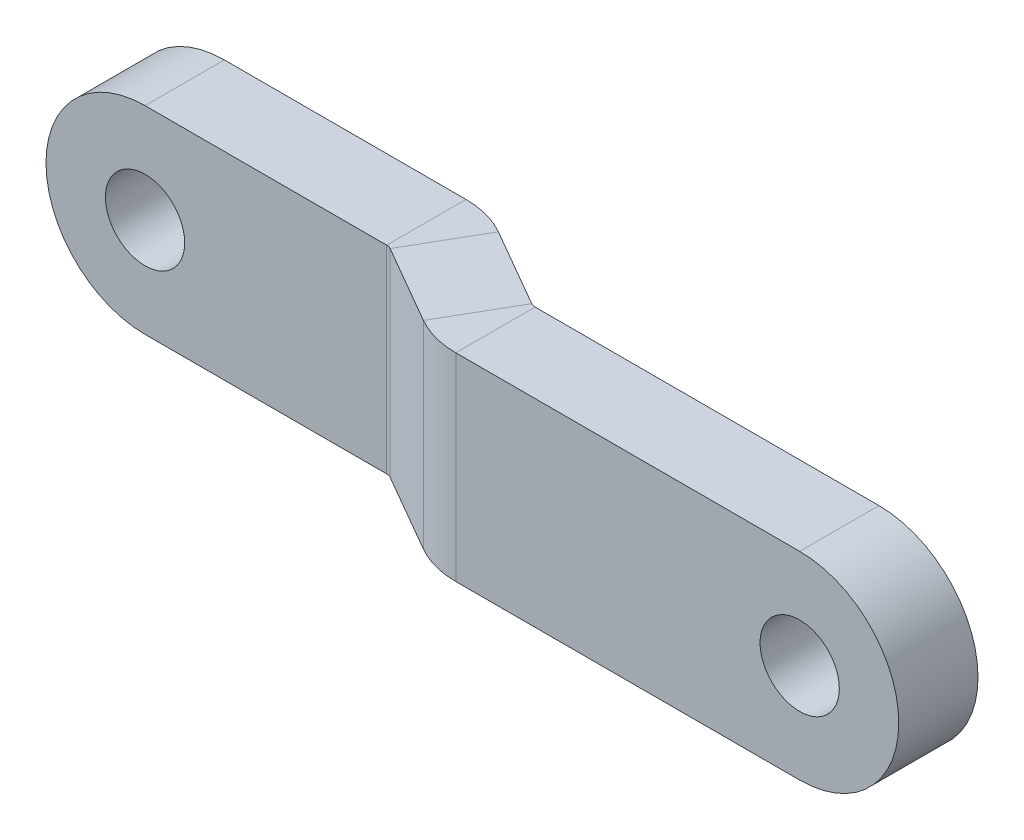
ISO-10303-21;
HEADER;
FILE_DESCRIPTION(('STEP AP214'),'2;1');
FILE_NAME('part.step','',(''),(''),'','','');
FILE_SCHEMA(('AUTOMOTIVE_DESIGN { 1 0 10303 214 1 1 1 1 }'));
ENDSEC;
DATA;
#1=APPLICATION_CONTEXT('core data for automotive mechanical design processes');
#2=APPLICATION_PROTOCOL_DEFINITION('international standard','automotive_design',2000,#1);
#3=PRODUCT_CONTEXT('',#1,'mechanical');
#4=PRODUCT('Part','Part','',(#3));
#5=PRODUCT_RELATED_PRODUCT_CATEGORY('part','',(#4));
#6=PRODUCT_DEFINITION_FORMATION('','',#4);
#7=PRODUCT_DEFINITION_CONTEXT('part definition',#1,'design');
#8=PRODUCT_DEFINITION('design','',#6,#7);
#9=PRODUCT_DEFINITION_SHAPE('','',#8);
#10=(LENGTH_UNIT() NAMED_UNIT(*) SI_UNIT(.MILLI.,.METRE.));
#11=(NAMED_UNIT(*) PLANE_ANGLE_UNIT() SI_UNIT($,.RADIAN.));
#12=(NAMED_UNIT(*) SI_UNIT($,.STERADIAN.) SOLID_ANGLE_UNIT());
#13=UNCERTAINTY_MEASURE_WITH_UNIT(LENGTH_MEASURE(1.E-05),#10,'distance_accuracy_value','');
#14=(GEOMETRIC_REPRESENTATION_CONTEXT(3) GLOBAL_UNCERTAINTY_ASSIGNED_CONTEXT((#13)) GLOBAL_UNIT_ASSIGNED_CONTEXT((#10,
#11,#12)) REPRESENTATION_CONTEXT('',''));
#15=CARTESIAN_POINT('',(0.,0.,0.));
#16=DIRECTION('',(0.,0.,1.));
#17=DIRECTION('',(1.,0.,0.));
#18=AXIS2_PLACEMENT_3D('',#15,#16,#17);
#19=CARTESIAN_POINT('',(-32.95222716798,0.,-14.7248971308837));
#20=DIRECTION('',(-0.500000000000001,0.,0.866025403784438));
#21=DIRECTION('',(0.866025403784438,0.,0.500000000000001));
#22=AXIS2_PLACEMENT_3D('',#19,#20,#21);
#23=PLANE('',#22);
#24=DIRECTION('',(-0.866025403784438,0.,-0.500000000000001));
#25=VECTOR('',#24,1.);
#26=CARTESIAN_POINT('',(-32.95222716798,7.9375,-14.7248971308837));
#27=LINE('',#26,#25);
#28=CARTESIAN_POINT('',(-9.09240845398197,7.9375,-0.949424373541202));
#29=VERTEX_POINT('',#28);
#30=CARTESIAN_POINT('',(-15.4176673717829,7.9375,-4.60131431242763));
#31=VERTEX_POINT('',#30);
#32=EDGE_CURVE('E252',#29,#31,#27,.T.);
#33=ORIENTED_EDGE('',*,*,#32,.T.);
#34=DIRECTION('',(0.,-1.,0.));
#35=VECTOR('',#34,1.);
#36=CARTESIAN_POINT('',(-15.4176673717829,0.,-4.60131431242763));
#37=LINE('',#36,#35);
#38=CARTESIAN_POINT('',(-15.4176673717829,-7.9375,-4.60131431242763));
#39=VERTEX_POINT('',#38);
#40=EDGE_CURVE('E52',#31,#39,#37,.T.);
#41=ORIENTED_EDGE('',*,*,#40,.T.);
#42=DIRECTION('',(0.866025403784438,0.,0.500000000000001));
#43=VECTOR('',#42,1.);
#44=CARTESIAN_POINT('',(-32.95222716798,-7.9375,-14.7248971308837));
#45=LINE('',#44,#43);
#46=CARTESIAN_POINT('',(-9.09240845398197,-7.9375,-0.949424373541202));
#47=VERTEX_POINT('',#46);
#48=EDGE_CURVE('E68',#39,#47,#45,.T.);
#49=ORIENTED_EDGE('',*,*,#48,.T.);
#50=DIRECTION('',(0.,-1.,0.));
#51=VECTOR('',#50,1.);
#52=CARTESIAN_POINT('',(-9.09240845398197,0.,-0.949424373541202));
#53=LINE('',#52,#51);
#54=EDGE_CURVE('E238',#29,#47,#53,.T.);
#55=ORIENTED_EDGE('',*,*,#54,.F.);
#56=EDGE_LOOP('',(#33,#41,#49,#55));
#57=FACE_BOUND('',#56,.T.);
#58=ADVANCED_FACE('F43',(#57),#23,.T.);
#59=CARTESIAN_POINT('',(-29.77722716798,-7.9375,-20.2241584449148));
#60=DIRECTION('',(0.,-1.,0.));
#61=DIRECTION('',(0.500000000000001,0.,-0.866025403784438));
#62=AXIS2_PLACEMENT_3D('',#59,#60,#61);
#63=PLANE('',#62);
#64=ORIENTED_EDGE('',*,*,#48,.F.);
#65=DIRECTION('',(0.500000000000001,0.,-0.866025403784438));
#66=VECTOR('',#65,1.);
#67=CARTESIAN_POINT('',(-12.2426673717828,-7.9375,-10.1005756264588));
#68=LINE('',#67,#66);
#69=CARTESIAN_POINT('',(-12.2426673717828,-7.9375,-10.1005756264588));
#70=VERTEX_POINT('',#69);
#71=EDGE_CURVE('E246',#39,#70,#68,.T.);
#72=ORIENTED_EDGE('',*,*,#71,.T.);
#73=DIRECTION('',(0.866025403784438,0.,0.500000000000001));
#74=VECTOR('',#73,1.);
#75=CARTESIAN_POINT('',(-29.77722716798,-7.9375,-20.2241584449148));
#76=LINE('',#75,#74);
#77=CARTESIAN_POINT('',(-5.91740845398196,-7.9375,-6.44868568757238));
#78=VERTEX_POINT('',#77);
#79=EDGE_CURVE('E47',#70,#78,#76,.T.);
#80=ORIENTED_EDGE('',*,*,#79,.T.);
#81=DIRECTION('',(0.500000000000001,0.,-0.866025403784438));
#82=VECTOR('',#81,1.);
#83=CARTESIAN_POINT('',(-5.91740845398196,-7.9375,-6.44868568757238));
#84=LINE('',#83,#82);
#85=EDGE_CURVE('E241',#47,#78,#84,.T.);
#86=ORIENTED_EDGE('',*,*,#85,.F.);
#87=EDGE_LOOP('',(#64,#72,#80,#86));
#88=FACE_BOUND('',#87,.T.);
#89=ADVANCED_FACE('F257',(#88),#63,.T.);
#90=CARTESIAN_POINT('',(-29.77722716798,7.9375,-20.2241584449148));
#91=DIRECTION('',(0.,1.,0.));
#92=DIRECTION('',(-0.500000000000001,0.,0.866025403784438));
#93=AXIS2_PLACEMENT_3D('',#90,#91,#92);
#94=PLANE('',#93);
#95=DIRECTION('',(-0.866025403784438,0.,-0.500000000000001));
#96=VECTOR('',#95,1.);
#97=CARTESIAN_POINT('',(-29.77722716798,7.9375,-20.2241584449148));
#98=LINE('',#97,#96);
#99=CARTESIAN_POINT('',(-5.91740845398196,7.9375,-6.44868568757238));
#100=VERTEX_POINT('',#99);
#101=CARTESIAN_POINT('',(-12.2426673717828,7.9375,-10.1005756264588));
#102=VERTEX_POINT('',#101);
#103=EDGE_CURVE('E235',#100,#102,#98,.T.);
#104=ORIENTED_EDGE('',*,*,#103,.T.);
#105=DIRECTION('',(-0.500000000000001,0.,0.866025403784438));
#106=VECTOR('',#105,1.);
#107=CARTESIAN_POINT('',(-12.2426673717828,7.9375,-10.1005756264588));
#108=LINE('',#107,#106);
#109=EDGE_CURVE('E12',#102,#31,#108,.T.);
#110=ORIENTED_EDGE('',*,*,#109,.T.);
#111=ORIENTED_EDGE('',*,*,#32,.F.);
#112=DIRECTION('',(-0.500000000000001,0.,0.866025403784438));
#113=VECTOR('',#112,1.);
#114=CARTESIAN_POINT('',(-5.91740845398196,7.9375,-6.44868568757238));
#115=LINE('',#114,#113);
#116=EDGE_CURVE('E234',#100,#29,#115,.T.);
#117=ORIENTED_EDGE('',*,*,#116,.F.);
#118=EDGE_LOOP('',(#104,#110,#111,#117));
#119=FACE_BOUND('',#118,.T.);
#120=ADVANCED_FACE('F45',(#119),#94,.T.);
#121=CARTESIAN_POINT('',(-29.77722716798,0.,-20.2241584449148));
#122=DIRECTION('',(-0.500000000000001,0.,0.866025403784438));
#123=DIRECTION('',(0.866025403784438,0.,0.500000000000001));
#124=AXIS2_PLACEMENT_3D('',#121,#122,#123);
#125=PLANE('',#124);
#126=DIRECTION('',(0.,-1.,0.));
#127=VECTOR('',#126,1.);
#128=CARTESIAN_POINT('',(-12.2426673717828,0.,-10.1005756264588));
#129=LINE('',#128,#127);
#130=EDGE_CURVE('E244',#102,#70,#129,.T.);
#131=ORIENTED_EDGE('',*,*,#130,.F.);
#132=ORIENTED_EDGE('',*,*,#103,.F.);
#133=DIRECTION('',(0.,-1.,0.));
#134=VECTOR('',#133,1.);
#135=CARTESIAN_POINT('',(-5.91740845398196,0.,-6.44868568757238));
#136=LINE('',#135,#134);
#137=EDGE_CURVE('E232',#100,#78,#136,.T.);
#138=ORIENTED_EDGE('',*,*,#137,.T.);
#139=ORIENTED_EDGE('',*,*,#79,.F.);
#140=EDGE_LOOP('',(#131,#132,#138,#139));
#141=FACE_BOUND('',#140,.T.);
#142=ADVANCED_FACE('F299',(#141),#125,.F.);
#143=CARTESIAN_POINT('',(22.0018370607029,0.,-6.35));
#144=DIRECTION('',(0.,0.,1.));
#145=DIRECTION('',(1.,0.,0.));
#146=AXIS2_PLACEMENT_3D('',#143,#144,#145);
#147=CYLINDRICAL_SURFACE('',#146,3.175);
#148=CARTESIAN_POINT('',(22.0018370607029,0.,-6.35));
#149=DIRECTION('',(0.,0.,1.));
#150=DIRECTION('',(1.,0.,0.));
#151=AXIS2_PLACEMENT_3D('',#148,#149,#150);
#152=CIRCLE('',#151,3.175);
#153=CARTESIAN_POINT('',(25.1768370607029,0.,-6.35));
#154=VERTEX_POINT('',#153);
#155=EDGE_CURVE('E220',#154,#154,#152,.T.);
#156=ORIENTED_EDGE('',*,*,#155,.F.);
#157=EDGE_LOOP('',(#156));
#158=FACE_BOUND('',#157,.T.);
#159=CARTESIAN_POINT('',(22.0018370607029,0.,0.));
#160=DIRECTION('',(0.,0.,1.));
#161=DIRECTION('',(1.,0.,0.));
#162=AXIS2_PLACEMENT_3D('',#159,#160,#161);
#163=CIRCLE('',#162,3.175);
#164=CARTESIAN_POINT('',(25.1768370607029,0.,0.));
#165=VERTEX_POINT('',#164);
#166=EDGE_CURVE('E228',#165,#165,#163,.T.);
#167=ORIENTED_EDGE('',*,*,#166,.T.);
#168=EDGE_LOOP('',(#167));
#169=FACE_BOUND('',#168,.T.);
#170=ADVANCED_FACE('F301',(#158,#169),#147,.F.);
#171=CARTESIAN_POINT('',(22.0018370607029,0.,-6.35));
#172=DIRECTION('',(0.,0.,1.));
#173=DIRECTION('',(1.,0.,0.));
#174=AXIS2_PLACEMENT_3D('',#171,#172,#173);
#175=CYLINDRICAL_SURFACE('',#174,7.9375);
#176=CARTESIAN_POINT('',(22.0018370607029,0.,0.));
#177=DIRECTION('',(0.,0.,1.));
#178=DIRECTION('',(1.,0.,0.));
#179=AXIS2_PLACEMENT_3D('',#176,#177,#178);
#180=CIRCLE('',#179,7.9375);
#181=CARTESIAN_POINT('',(22.0018370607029,-7.9375,0.));
#182=VERTEX_POINT('',#181);
#183=CARTESIAN_POINT('',(22.0018370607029,7.9375,0.));
#184=VERTEX_POINT('',#183);
#185=EDGE_CURVE('E203',#182,#184,#180,.T.);
#186=ORIENTED_EDGE('',*,*,#185,.F.);
#187=DIRECTION('',(0.,0.,1.));
#188=VECTOR('',#187,1.);
#189=CARTESIAN_POINT('',(22.0018370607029,-7.9375,-6.35));
#190=LINE('',#189,#188);
#191=CARTESIAN_POINT('',(22.0018370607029,-7.9375,-6.35));
#192=VERTEX_POINT('',#191);
#193=EDGE_CURVE('E195',#192,#182,#190,.T.);
#194=ORIENTED_EDGE('',*,*,#193,.F.);
#195=CARTESIAN_POINT('',(22.0018370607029,0.,-6.35));
#196=DIRECTION('',(0.,0.,1.));
#197=DIRECTION('',(1.,0.,0.));
#198=AXIS2_PLACEMENT_3D('',#195,#196,#197);
#199=CIRCLE('',#198,7.9375);
#200=CARTESIAN_POINT('',(22.0018370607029,7.9375,-6.35));
#201=VERTEX_POINT('',#200);
#202=EDGE_CURVE('E225',#192,#201,#199,.T.);
#203=ORIENTED_EDGE('',*,*,#202,.T.);
#204=DIRECTION('',(0.,0.,1.));
#205=VECTOR('',#204,1.);
#206=CARTESIAN_POINT('',(22.0018370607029,7.9375,-6.35));
#207=LINE('',#206,#205);
#208=EDGE_CURVE('E223',#201,#184,#207,.T.);
#209=ORIENTED_EDGE('',*,*,#208,.T.);
#210=EDGE_LOOP('',(#186,#194,#203,#209));
#211=FACE_BOUND('',#210,.T.);
#212=ADVANCED_FACE('F281',(#211),#175,.T.);
#213=CARTESIAN_POINT('',(-35.1481629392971,0.,-6.35));
#214=DIRECTION('',(0.,0.,1.));
#215=DIRECTION('',(1.,0.,0.));
#216=AXIS2_PLACEMENT_3D('',#213,#214,#215);
#217=PLANE('',#216);
#218=DIRECTION('',(0.,-1.,0.));
#219=VECTOR('',#218,1.);
#220=CARTESIAN_POINT('',(-5.54910845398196,0.,-6.35));
#221=LINE('',#220,#219);
#222=CARTESIAN_POINT('',(-5.54910845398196,7.9375,-6.35));
#223=VERTEX_POINT('',#222);
#224=CARTESIAN_POINT('',(-5.54910845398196,-7.9375,-6.35));
#225=VERTEX_POINT('',#224);
#226=EDGE_CURVE('E191',#223,#225,#221,.T.);
#227=ORIENTED_EDGE('',*,*,#226,.F.);
#228=DIRECTION('',(-1.,0.,0.));
#229=VECTOR('',#228,1.);
#230=CARTESIAN_POINT('',(-35.1481629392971,7.9375,-6.35));
#231=LINE('',#230,#229);
#232=EDGE_CURVE('E217',#201,#223,#231,.T.);
#233=ORIENTED_EDGE('',*,*,#232,.F.);
#234=ORIENTED_EDGE('',*,*,#202,.F.);
#235=DIRECTION('',(1.,0.,0.));
#236=VECTOR('',#235,1.);
#237=CARTESIAN_POINT('',(-35.1481629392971,-7.9375,-6.35));
#238=LINE('',#237,#236);
#239=EDGE_CURVE('E198',#225,#192,#238,.T.);
#240=ORIENTED_EDGE('',*,*,#239,.F.);
#241=EDGE_LOOP('',(#227,#233,#234,#240));
#242=FACE_BOUND('',#241,.T.);
#243=ORIENTED_EDGE('',*,*,#155,.T.);
#244=EDGE_LOOP('',(#243));
#245=FACE_BOUND('',#244,.T.);
#246=ADVANCED_FACE('F272',(#242,#245),#217,.F.);
#247=CARTESIAN_POINT('',(-35.1481629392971,7.9375,-6.35));
#248=DIRECTION('',(0.,1.,0.));
#249=DIRECTION('',(0.,0.,1.));
#250=AXIS2_PLACEMENT_3D('',#247,#248,#249);
#251=PLANE('',#250);
#252=ORIENTED_EDGE('',*,*,#232,.T.);
#253=DIRECTION('',(0.,0.,1.));
#254=VECTOR('',#253,1.);
#255=CARTESIAN_POINT('',(-5.54910845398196,7.9375,-6.35));
#256=LINE('',#255,#254);
#257=CARTESIAN_POINT('',(-5.54910845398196,7.9375,0.));
#258=VERTEX_POINT('',#257);
#259=EDGE_CURVE('E214',#223,#258,#256,.T.);
#260=ORIENTED_EDGE('',*,*,#259,.T.);
#261=DIRECTION('',(-1.,0.,0.));
#262=VECTOR('',#261,1.);
#263=CARTESIAN_POINT('',(-35.1481629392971,7.9375,0.));
#264=LINE('',#263,#262);
#265=EDGE_CURVE('E211',#184,#258,#264,.T.);
#266=ORIENTED_EDGE('',*,*,#265,.F.);
#267=ORIENTED_EDGE('',*,*,#208,.F.);
#268=EDGE_LOOP('',(#252,#260,#266,#267));
#269=FACE_BOUND('',#268,.T.);
#270=ADVANCED_FACE('F276',(#269),#251,.T.);
#271=CARTESIAN_POINT('',(-35.1481629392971,0.,0.));
#272=DIRECTION('',(0.,0.,1.));
#273=DIRECTION('',(1.,0.,0.));
#274=AXIS2_PLACEMENT_3D('',#271,#272,#273);
#275=PLANE('',#274);
#276=ORIENTED_EDGE('',*,*,#166,.F.);
#277=EDGE_LOOP('',(#276));
#278=FACE_BOUND('',#277,.T.);
#279=ORIENTED_EDGE('',*,*,#265,.T.);
#280=DIRECTION('',(0.,-1.,0.));
#281=VECTOR('',#280,1.);
#282=CARTESIAN_POINT('',(-5.54910845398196,0.,0.));
#283=LINE('',#282,#281);
#284=CARTESIAN_POINT('',(-5.54910845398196,-7.9375,0.));
#285=VERTEX_POINT('',#284);
#286=EDGE_CURVE('E208',#258,#285,#283,.T.);
#287=ORIENTED_EDGE('',*,*,#286,.T.);
#288=DIRECTION('',(1.,0.,0.));
#289=VECTOR('',#288,1.);
#290=CARTESIAN_POINT('',(-35.1481629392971,-7.9375,0.));
#291=LINE('',#290,#289);
#292=EDGE_CURVE('E206',#285,#182,#291,.T.);
#293=ORIENTED_EDGE('',*,*,#292,.T.);
#294=ORIENTED_EDGE('',*,*,#185,.T.);
#295=EDGE_LOOP('',(#279,#287,#293,#294));
#296=FACE_BOUND('',#295,.T.);
#297=ADVANCED_FACE('F361',(#278,#296),#275,.T.);
#298=CARTESIAN_POINT('',(-35.1481629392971,-7.9375,-6.35));
#299=DIRECTION('',(0.,-1.,0.));
#300=DIRECTION('',(0.,0.,-1.));
#301=AXIS2_PLACEMENT_3D('',#298,#299,#300);
#302=PLANE('',#301);
#303=ORIENTED_EDGE('',*,*,#292,.F.);
#304=DIRECTION('',(0.,0.,-1.));
#305=VECTOR('',#304,1.);
#306=CARTESIAN_POINT('',(-5.54910845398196,-7.9375,-6.35));
#307=LINE('',#306,#305);
#308=EDGE_CURVE('E200',#285,#225,#307,.T.);
#309=ORIENTED_EDGE('',*,*,#308,.T.);
#310=ORIENTED_EDGE('',*,*,#239,.T.);
#311=ORIENTED_EDGE('',*,*,#193,.T.);
#312=EDGE_LOOP('',(#303,#309,#310,#311));
#313=FACE_BOUND('',#312,.T.);
#314=ADVANCED_FACE('F284',(#313),#302,.T.);
#315=CARTESIAN_POINT('',(-5.54910845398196,7.9375,-7.0866));
#316=DIRECTION('',(0.,-1.,0.));
#317=DIRECTION('',(0.,0.,-1.));
#318=AXIS2_PLACEMENT_3D('',#315,#316,#317);
#319=PLANE('',#318);
#320=ORIENTED_EDGE('',*,*,#116,.T.);
#321=CARTESIAN_POINT('',(-5.54910845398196,7.9375,-7.0866));
#322=DIRECTION('',(0.,1.,0.));
#323=DIRECTION('',(0.,0.,1.));
#324=AXIS2_PLACEMENT_3D('',#321,#322,#323);
#325=CIRCLE('',#324,7.0866);
#326=EDGE_CURVE('E180',#29,#258,#325,.T.);
#327=ORIENTED_EDGE('',*,*,#326,.T.);
#328=ORIENTED_EDGE('',*,*,#259,.F.);
#329=CARTESIAN_POINT('',(-5.54910845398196,7.9375,-7.0866));
#330=DIRECTION('',(0.,1.,0.));
#331=DIRECTION('',(0.,0.,-1.));
#332=AXIS2_PLACEMENT_3D('',#329,#330,#331);
#333=CIRCLE('',#332,0.7366);
#334=EDGE_CURVE('E184',#100,#223,#333,.T.);
#335=ORIENTED_EDGE('',*,*,#334,.F.);
#336=EDGE_LOOP('',(#320,#327,#328,#335));
#337=FACE_BOUND('',#336,.T.);
#338=ADVANCED_FACE('F291',(#337),#319,.F.);
#339=CARTESIAN_POINT('',(-5.54910845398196,-7.9375,-7.0866));
#340=DIRECTION('',(0.,1.,0.));
#341=DIRECTION('',(0.,0.,1.));
#342=AXIS2_PLACEMENT_3D('',#339,#340,#341);
#343=PLANE('',#342);
#344=ORIENTED_EDGE('',*,*,#308,.F.);
#345=CARTESIAN_POINT('',(-5.54910845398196,-7.9375,-7.0866));
#346=DIRECTION('',(0.,1.,0.));
#347=DIRECTION('',(0.,0.,1.));
#348=AXIS2_PLACEMENT_3D('',#345,#346,#347);
#349=CIRCLE('',#348,7.0866);
#350=EDGE_CURVE('E188',#285,#47,#349,.F.);
#351=ORIENTED_EDGE('',*,*,#350,.T.);
#352=ORIENTED_EDGE('',*,*,#85,.T.);
#353=CARTESIAN_POINT('',(-5.54910845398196,-7.9375,-7.0866));
#354=DIRECTION('',(0.,-1.,0.));
#355=DIRECTION('',(0.,0.,1.));
#356=AXIS2_PLACEMENT_3D('',#353,#354,#355);
#357=CIRCLE('',#356,0.7366);
#358=EDGE_CURVE('E187',#225,#78,#357,.T.);
#359=ORIENTED_EDGE('',*,*,#358,.F.);
#360=EDGE_LOOP('',(#344,#351,#352,#359));
#361=FACE_BOUND('',#360,.T.);
#362=ADVANCED_FACE('F262',(#361),#343,.F.);
#363=CARTESIAN_POINT('',(-5.54910845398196,-17.220129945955,-7.0866));
#364=DIRECTION('',(0.,1.,0.));
#365=DIRECTION('',(0.,0.,1.));
#366=AXIS2_PLACEMENT_3D('',#363,#364,#365);
#367=CYLINDRICAL_SURFACE('',#366,0.7366);
#368=ORIENTED_EDGE('',*,*,#358,.T.);
#369=ORIENTED_EDGE('',*,*,#137,.F.);
#370=ORIENTED_EDGE('',*,*,#334,.T.);
#371=ORIENTED_EDGE('',*,*,#226,.T.);
#372=EDGE_LOOP('',(#368,#369,#370,#371));
#373=FACE_BOUND('',#372,.T.);
#374=ADVANCED_FACE('F267',(#373),#367,.F.);
#375=CARTESIAN_POINT('',(-5.54910845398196,-17.220129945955,-7.0866));
#376=DIRECTION('',(0.,1.,0.));
#377=DIRECTION('',(0.,0.,1.));
#378=AXIS2_PLACEMENT_3D('',#375,#376,#377);
#379=CYLINDRICAL_SURFACE('',#378,7.0866);
#380=ORIENTED_EDGE('',*,*,#350,.F.);
#381=ORIENTED_EDGE('',*,*,#286,.F.);
#382=ORIENTED_EDGE('',*,*,#326,.F.);
#383=ORIENTED_EDGE('',*,*,#54,.T.);
#384=EDGE_LOOP('',(#380,#381,#382,#383));
#385=FACE_BOUND('',#384,.T.);
#386=ADVANCED_FACE('F287',(#385),#379,.T.);
#387=CARTESIAN_POINT('',(-15.7859673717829,7.9375,-3.96340000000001));
#388=DIRECTION('',(0.,1.,0.));
#389=DIRECTION('',(0.,0.,1.));
#390=AXIS2_PLACEMENT_3D('',#387,#388,#389);
#391=PLANE('',#390);
#392=DIRECTION('',(0.,0.,1.));
#393=VECTOR('',#392,1.);
#394=CARTESIAN_POINT('',(-15.7859673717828,7.9375,-11.05));
#395=LINE('',#394,#393);
#396=CARTESIAN_POINT('',(-15.7859673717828,7.9375,-11.05));
#397=VERTEX_POINT('',#396);
#398=CARTESIAN_POINT('',(-15.7859673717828,7.9375,-4.70000000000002));
#399=VERTEX_POINT('',#398);
#400=EDGE_CURVE('E142',#397,#399,#395,.T.);
#401=ORIENTED_EDGE('',*,*,#400,.T.);
#402=CARTESIAN_POINT('',(-15.7859673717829,7.9375,-3.96340000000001));
#403=DIRECTION('',(0.,1.,0.));
#404=DIRECTION('',(0.,0.,1.));
#405=AXIS2_PLACEMENT_3D('',#402,#403,#404);
#406=CIRCLE('',#405,0.7366);
#407=EDGE_CURVE('E60',#399,#31,#406,.F.);
#408=ORIENTED_EDGE('',*,*,#407,.T.);
#409=ORIENTED_EDGE('',*,*,#109,.F.);
#410=CARTESIAN_POINT('',(-15.7859673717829,7.9375,-3.96340000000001));
#411=DIRECTION('',(0.,-1.,0.));
#412=DIRECTION('',(0.,0.,1.));
#413=AXIS2_PLACEMENT_3D('',#410,#411,#412);
#414=CIRCLE('',#413,7.0866);
#415=EDGE_CURVE('E173',#397,#102,#414,.T.);
#416=ORIENTED_EDGE('',*,*,#415,.F.);
#417=EDGE_LOOP('',(#401,#408,#409,#416));
#418=FACE_BOUND('',#417,.T.);
#419=ADVANCED_FACE('F293',(#418),#391,.T.);
#420=CARTESIAN_POINT('',(-15.7859673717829,-7.9375,-3.96340000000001));
#421=DIRECTION('',(0.,-1.,0.));
#422=DIRECTION('',(0.,0.,-1.));
#423=AXIS2_PLACEMENT_3D('',#420,#421,#422);
#424=PLANE('',#423);
#425=ORIENTED_EDGE('',*,*,#71,.F.);
#426=CARTESIAN_POINT('',(-15.7859673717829,-7.9375,-3.96340000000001));
#427=DIRECTION('',(0.,1.,0.));
#428=DIRECTION('',(0.,0.,1.));
#429=AXIS2_PLACEMENT_3D('',#426,#427,#428);
#430=CIRCLE('',#429,0.7366);
#431=CARTESIAN_POINT('',(-15.7859673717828,-7.9375,-4.70000000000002));
#432=VERTEX_POINT('',#431);
#433=EDGE_CURVE('E177',#39,#432,#430,.T.);
#434=ORIENTED_EDGE('',*,*,#433,.T.);
#435=DIRECTION('',(0.,0.,-1.));
#436=VECTOR('',#435,1.);
#437=CARTESIAN_POINT('',(-15.7859673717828,-7.9375,-11.05));
#438=LINE('',#437,#436);
#439=CARTESIAN_POINT('',(-15.7859673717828,-7.9375,-11.05));
#440=VERTEX_POINT('',#439);
#441=EDGE_CURVE('E161',#432,#440,#438,.T.);
#442=ORIENTED_EDGE('',*,*,#441,.T.);
#443=CARTESIAN_POINT('',(-15.7859673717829,-7.9375,-3.96340000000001));
#444=DIRECTION('',(0.,1.,0.));
#445=DIRECTION('',(0.,0.,-1.));
#446=AXIS2_PLACEMENT_3D('',#443,#444,#445);
#447=CIRCLE('',#446,7.0866);
#448=EDGE_CURVE('E176',#70,#440,#447,.T.);
#449=ORIENTED_EDGE('',*,*,#448,.F.);
#450=EDGE_LOOP('',(#425,#434,#442,#449));
#451=FACE_BOUND('',#450,.T.);
#452=ADVANCED_FACE('F425',(#451),#424,.T.);
#453=CARTESIAN_POINT('',(-15.7859673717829,-17.8622240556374,-3.96340000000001));
#454=DIRECTION('',(0.,1.,0.));
#455=DIRECTION('',(0.,0.,1.));
#456=AXIS2_PLACEMENT_3D('',#453,#454,#455);
#457=CYLINDRICAL_SURFACE('',#456,7.0866);
#458=ORIENTED_EDGE('',*,*,#448,.T.);
#459=DIRECTION('',(0.,-1.,0.));
#460=VECTOR('',#459,1.);
#461=CARTESIAN_POINT('',(-15.7859673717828,0.,-11.05));
#462=LINE('',#461,#460);
#463=EDGE_CURVE('E298',#397,#440,#462,.T.);
#464=ORIENTED_EDGE('',*,*,#463,.F.);
#465=ORIENTED_EDGE('',*,*,#415,.T.);
#466=ORIENTED_EDGE('',*,*,#130,.T.);
#467=EDGE_LOOP('',(#458,#464,#465,#466));
#468=FACE_BOUND('',#467,.T.);
#469=ADVANCED_FACE('F296',(#468),#457,.T.);
#470=CARTESIAN_POINT('',(-15.7859673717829,-17.8622240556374,-3.96340000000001));
#471=DIRECTION('',(0.,1.,0.));
#472=DIRECTION('',(0.,0.,1.));
#473=AXIS2_PLACEMENT_3D('',#470,#471,#472);
#474=CYLINDRICAL_SURFACE('',#473,0.7366);
#475=ORIENTED_EDGE('',*,*,#433,.F.);
#476=ORIENTED_EDGE('',*,*,#40,.F.);
#477=ORIENTED_EDGE('',*,*,#407,.F.);
#478=DIRECTION('',(0.,-1.,0.));
#479=VECTOR('',#478,1.);
#480=CARTESIAN_POINT('',(-15.7859673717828,0.,-4.70000000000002));
#481=LINE('',#480,#479);
#482=EDGE_CURVE('E166',#399,#432,#481,.T.);
#483=ORIENTED_EDGE('',*,*,#482,.T.);
#484=EDGE_LOOP('',(#475,#476,#477,#483));
#485=FACE_BOUND('',#484,.T.);
#486=ADVANCED_FACE('F445',(#485),#474,.F.);
#487=CARTESIAN_POINT('',(-35.1481629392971,0.,-11.05));
#488=DIRECTION('',(0.,0.,1.));
#489=DIRECTION('',(1.,0.,0.));
#490=AXIS2_PLACEMENT_3D('',#487,#488,#489);
#491=CYLINDRICAL_SURFACE('',#490,7.9375);
#492=CARTESIAN_POINT('',(-35.1481629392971,0.,-4.70000000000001));
#493=DIRECTION('',(0.,0.,1.));
#494=DIRECTION('',(1.,0.,0.));
#495=AXIS2_PLACEMENT_3D('',#492,#493,#494);
#496=CIRCLE('',#495,7.9375);
#497=CARTESIAN_POINT('',(-35.1481629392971,7.9375,-4.70000000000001));
#498=VERTEX_POINT('',#497);
#499=CARTESIAN_POINT('',(-35.1481629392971,-7.9375,-4.70000000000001));
#500=VERTEX_POINT('',#499);
#501=EDGE_CURVE('E155',#498,#500,#496,.T.);
#502=ORIENTED_EDGE('',*,*,#501,.F.);
#503=DIRECTION('',(0.,0.,1.));
#504=VECTOR('',#503,1.);
#505=CARTESIAN_POINT('',(-35.1481629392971,7.9375,-11.05));
#506=LINE('',#505,#504);
#507=CARTESIAN_POINT('',(-35.1481629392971,7.9375,-11.05));
#508=VERTEX_POINT('',#507);
#509=EDGE_CURVE('E140',#508,#498,#506,.T.);
#510=ORIENTED_EDGE('',*,*,#509,.F.);
#511=CARTESIAN_POINT('',(-35.1481629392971,0.,-11.05));
#512=DIRECTION('',(0.,0.,1.));
#513=DIRECTION('',(1.,0.,0.));
#514=AXIS2_PLACEMENT_3D('',#511,#512,#513);
#515=CIRCLE('',#514,7.9375);
#516=CARTESIAN_POINT('',(-35.1481629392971,-7.9375,-11.05));
#517=VERTEX_POINT('',#516);
#518=EDGE_CURVE('E153',#508,#517,#515,.T.);
#519=ORIENTED_EDGE('',*,*,#518,.T.);
#520=DIRECTION('',(0.,0.,1.));
#521=VECTOR('',#520,1.);
#522=CARTESIAN_POINT('',(-35.1481629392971,-7.9375,-11.05));
#523=LINE('',#522,#521);
#524=EDGE_CURVE('E160',#517,#500,#523,.T.);
#525=ORIENTED_EDGE('',*,*,#524,.T.);
#526=EDGE_LOOP('',(#502,#510,#519,#525));
#527=FACE_BOUND('',#526,.T.);
#528=ADVANCED_FACE('F151',(#527),#491,.T.);
#529=CARTESIAN_POINT('',(-35.1481629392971,0.,-11.05));
#530=DIRECTION('',(0.,0.,1.));
#531=DIRECTION('',(1.,0.,0.));
#532=AXIS2_PLACEMENT_3D('',#529,#530,#531);
#533=CYLINDRICAL_SURFACE('',#532,3.175);
#534=CARTESIAN_POINT('',(-35.1481629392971,0.,-11.05));
#535=DIRECTION('',(0.,0.,1.));
#536=DIRECTION('',(1.,0.,0.));
#537=AXIS2_PLACEMENT_3D('',#534,#535,#536);
#538=CIRCLE('',#537,3.175);
#539=CARTESIAN_POINT('',(-31.9731629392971,0.,-11.05));
#540=VERTEX_POINT('',#539);
#541=EDGE_CURVE('E538',#540,#540,#538,.T.);
#542=ORIENTED_EDGE('',*,*,#541,.F.);
#543=EDGE_LOOP('',(#542));
#544=FACE_BOUND('',#543,.T.);
#545=CARTESIAN_POINT('',(-35.1481629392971,0.,-4.70000000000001));
#546=DIRECTION('',(0.,0.,1.));
#547=DIRECTION('',(1.,0.,0.));
#548=AXIS2_PLACEMENT_3D('',#545,#546,#547);
#549=CIRCLE('',#548,3.175);
#550=CARTESIAN_POINT('',(-31.9731629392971,0.,-4.70000000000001));
#551=VERTEX_POINT('',#550);
#552=EDGE_CURVE('E163',#551,#551,#549,.T.);
#553=ORIENTED_EDGE('',*,*,#552,.T.);
#554=EDGE_LOOP('',(#553));
#555=FACE_BOUND('',#554,.T.);
#556=ADVANCED_FACE('F466',(#544,#555),#533,.F.);
#557=CARTESIAN_POINT('',(-33.9850240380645,0.,-11.05));
#558=DIRECTION('',(0.,0.,1.));
#559=DIRECTION('',(1.,0.,0.));
#560=AXIS2_PLACEMENT_3D('',#557,#558,#559);
#561=PLANE('',#560);
#562=ORIENTED_EDGE('',*,*,#541,.T.);
#563=EDGE_LOOP('',(#562));
#564=FACE_BOUND('',#563,.T.);
#565=DIRECTION('',(-1.,0.,0.));
#566=VECTOR('',#565,1.);
#567=CARTESIAN_POINT('',(-33.9850240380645,7.9375,-11.05));
#568=LINE('',#567,#566);
#569=EDGE_CURVE('E137',#397,#508,#568,.T.);
#570=ORIENTED_EDGE('',*,*,#569,.F.);
#571=ORIENTED_EDGE('',*,*,#463,.T.);
#572=DIRECTION('',(1.,0.,0.));
#573=VECTOR('',#572,1.);
#574=CARTESIAN_POINT('',(-33.9850240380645,-7.9375,-11.05));
#575=LINE('',#574,#573);
#576=EDGE_CURVE('E158',#517,#440,#575,.T.);
#577=ORIENTED_EDGE('',*,*,#576,.F.);
#578=ORIENTED_EDGE('',*,*,#518,.F.);
#579=EDGE_LOOP('',(#570,#571,#577,#578));
#580=FACE_BOUND('',#579,.T.);
#581=ADVANCED_FACE('F157',(#564,#580),#561,.F.);
#582=CARTESIAN_POINT('',(-33.9850240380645,-7.9375,-11.05));
#583=DIRECTION('',(0.,-1.,0.));
#584=DIRECTION('',(0.,0.,-1.));
#585=AXIS2_PLACEMENT_3D('',#582,#583,#584);
#586=PLANE('',#585);
#587=ORIENTED_EDGE('',*,*,#441,.F.);
#588=DIRECTION('',(1.,0.,0.));
#589=VECTOR('',#588,1.);
#590=CARTESIAN_POINT('',(-33.9850240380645,-7.9375,-4.70000000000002));
#591=LINE('',#590,#589);
#592=EDGE_CURVE('E147',#500,#432,#591,.T.);
#593=ORIENTED_EDGE('',*,*,#592,.F.);
#594=ORIENTED_EDGE('',*,*,#524,.F.);
#595=ORIENTED_EDGE('',*,*,#576,.T.);
#596=EDGE_LOOP('',(#587,#593,#594,#595));
#597=FACE_BOUND('',#596,.T.);
#598=ADVANCED_FACE('F483',(#597),#586,.T.);
#599=CARTESIAN_POINT('',(-33.9850240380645,0.,-4.70000000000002));
#600=DIRECTION('',(0.,0.,1.));
#601=DIRECTION('',(1.,0.,0.));
#602=AXIS2_PLACEMENT_3D('',#599,#600,#601);
#603=PLANE('',#602);
#604=ORIENTED_EDGE('',*,*,#482,.F.);
#605=DIRECTION('',(-1.,0.,0.));
#606=VECTOR('',#605,1.);
#607=CARTESIAN_POINT('',(-33.9850240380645,7.9375,-4.70000000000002));
#608=LINE('',#607,#606);
#609=EDGE_CURVE('E544',#399,#498,#608,.T.);
#610=ORIENTED_EDGE('',*,*,#609,.T.);
#611=ORIENTED_EDGE('',*,*,#501,.T.);
#612=ORIENTED_EDGE('',*,*,#592,.T.);
#613=EDGE_LOOP('',(#604,#610,#611,#612));
#614=FACE_BOUND('',#613,.T.);
#615=ORIENTED_EDGE('',*,*,#552,.F.);
#616=EDGE_LOOP('',(#615));
#617=FACE_BOUND('',#616,.T.);
#618=ADVANCED_FACE('F494',(#614,#617),#603,.T.);
#619=CARTESIAN_POINT('',(-33.9850240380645,7.9375,-11.05));
#620=DIRECTION('',(0.,1.,0.));
#621=DIRECTION('',(0.,0.,1.));
#622=AXIS2_PLACEMENT_3D('',#619,#620,#621);
#623=PLANE('',#622);
#624=ORIENTED_EDGE('',*,*,#400,.F.);
#625=ORIENTED_EDGE('',*,*,#569,.T.);
#626=ORIENTED_EDGE('',*,*,#509,.T.);
#627=ORIENTED_EDGE('',*,*,#609,.F.);
#628=EDGE_LOOP('',(#624,#625,#626,#627));
#629=FACE_BOUND('',#628,.T.);
#630=ADVANCED_FACE('F139',(#629),#623,.T.);
#631=CLOSED_SHELL('',(#58,#89,#120,#142,#170,#212,#246,#270,#297,#314,#338,#362,#374,#386,#419,
#452,#469,#486,#528,#556,#581,#598,#618,#630));
#632=MANIFOLD_SOLID_BREP('B2',#631);
#633=ADVANCED_BREP_SHAPE_REPRESENTATION('',(#18,#632),#14);
#634=SHAPE_DEFINITION_REPRESENTATION(#9,#633);
ENDSEC;
END-ISO-10303-21;
